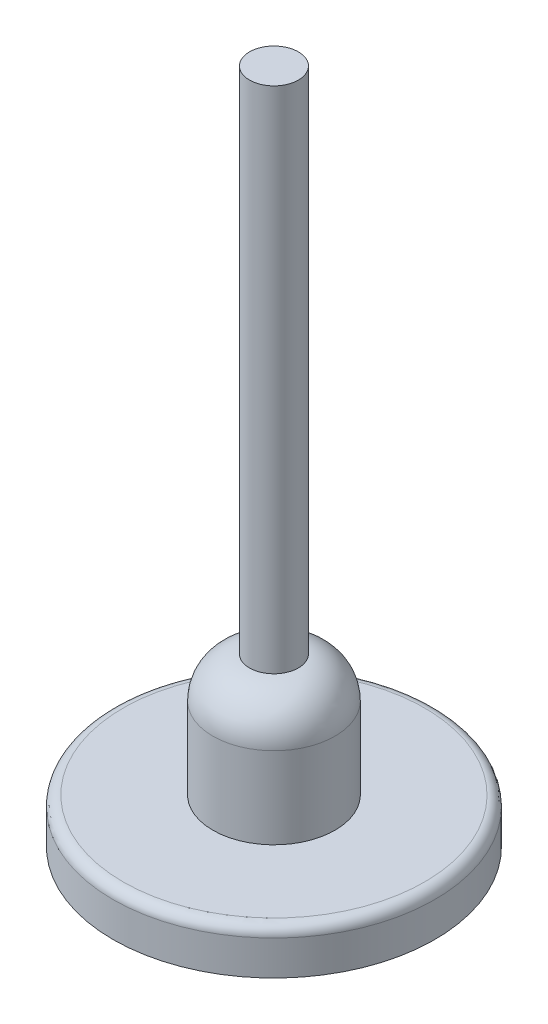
from build123d import *

# Parameters (mm, degrees)
ESQUISSE1_R      = 39.5
EXTRUSION1_DEPTH = 11
CONG_1_R         = 2.5
ESQUISSE2_R      = 15
EXTRUSION2_DEPTH = 30
CONG_3_R         = 10
ESQUISSE4_R      = 6
EXTRUSION3_DEPTH = 125


with BuildPart() as part:
    # Esquisse1 → Extrusion1 (new body)
    with BuildSketch(Plane(origin=(0, 0, 0), x_dir=(1, 0, 0), z_dir=(0, 1, 0))):
        with Locations(Location((0, 0, 0), (0, 0, 270))):
            Circle(ESQUISSE1_R)
    extrude(amount=EXTRUSION1_DEPTH)

    # Cong_1
    cong_1_edges = [part.edges().sort_by_distance(p)[0] for p in [
        (0, 11, -39.5),
    ]]
    fillet(cong_1_edges, radius=CONG_1_R)

    # Esquisse2 → Extrusion2 (add)
    with BuildSketch(Plane(origin=(0, 11, 0), x_dir=(-1, 0, 0), z_dir=(0, 1, 0))):
        with Locations(Location((0, 0, 0), (0, 0, 90))):
            Circle(ESQUISSE2_R)
    extrude(amount=EXTRUSION2_DEPTH)

    # Cong_3
    cong_3_edges = [part.edges().sort_by_distance(p)[0] for p in [
        (0, 41, -15),
    ]]
    fillet(cong_3_edges, radius=CONG_3_R)

    # Esquisse4 → Extrusion3 (add)
    with BuildSketch(Plane(origin=(0, 41, 0), x_dir=(1, 0, 0), z_dir=(0, 1, 0))):
        with Locations(Location((0, 0, 0), (0, 0, 270))):
            Circle(ESQUISSE4_R)
    extrude(amount=EXTRUSION3_DEPTH)


solid = part.part
